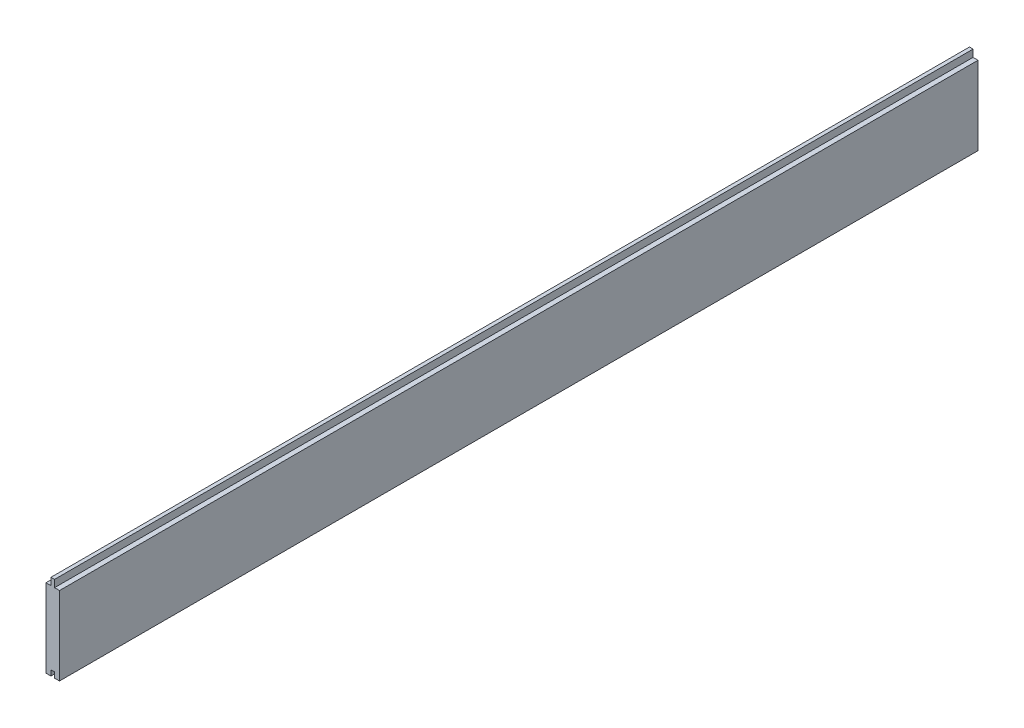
ISO-10303-21;
HEADER;
FILE_DESCRIPTION(('STEP AP214'),'2;1');
FILE_NAME('part.step','',(''),(''),'','','');
FILE_SCHEMA(('AUTOMOTIVE_DESIGN { 1 0 10303 214 1 1 1 1 }'));
ENDSEC;
DATA;
#1=APPLICATION_CONTEXT('core data for automotive mechanical design processes');
#2=APPLICATION_PROTOCOL_DEFINITION('international standard','automotive_design',2000,#1);
#3=PRODUCT_CONTEXT('',#1,'mechanical');
#4=PRODUCT('Part','Part','',(#3));
#5=PRODUCT_RELATED_PRODUCT_CATEGORY('part','',(#4));
#6=PRODUCT_DEFINITION_FORMATION('','',#4);
#7=PRODUCT_DEFINITION_CONTEXT('part definition',#1,'design');
#8=PRODUCT_DEFINITION('design','',#6,#7);
#9=PRODUCT_DEFINITION_SHAPE('','',#8);
#10=(LENGTH_UNIT() NAMED_UNIT(*) SI_UNIT(.MILLI.,.METRE.));
#11=(NAMED_UNIT(*) PLANE_ANGLE_UNIT() SI_UNIT($,.RADIAN.));
#12=(NAMED_UNIT(*) SI_UNIT($,.STERADIAN.) SOLID_ANGLE_UNIT());
#13=UNCERTAINTY_MEASURE_WITH_UNIT(LENGTH_MEASURE(1.E-05),#10,'distance_accuracy_value','');
#14=(GEOMETRIC_REPRESENTATION_CONTEXT(3) GLOBAL_UNCERTAINTY_ASSIGNED_CONTEXT((#13)) GLOBAL_UNIT_ASSIGNED_CONTEXT((#10,
#11,#12)) REPRESENTATION_CONTEXT('',''));
#15=CARTESIAN_POINT('',(0.,0.,0.));
#16=DIRECTION('',(0.,0.,1.));
#17=DIRECTION('',(1.,0.,0.));
#18=AXIS2_PLACEMENT_3D('',#15,#16,#17);
#19=CARTESIAN_POINT('',(1.99999999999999,0.,1020.));
#20=DIRECTION('',(1.,0.,0.));
#21=DIRECTION('',(0.,1.,0.));
#22=AXIS2_PLACEMENT_3D('',#19,#20,#21);
#23=PLANE('',#22);
#24=DIRECTION('',(0.,-1.,0.));
#25=VECTOR('',#24,1.);
#26=CARTESIAN_POINT('',(1.99999999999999,0.,0.));
#27=LINE('',#26,#25);
#28=CARTESIAN_POINT('',(1.99999999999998,51.5,0.));
#29=VERTEX_POINT('',#28);
#30=CARTESIAN_POINT('',(1.99999999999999,43.5,0.));
#31=VERTEX_POINT('',#30);
#32=EDGE_CURVE('E152',#29,#31,#27,.T.);
#33=ORIENTED_EDGE('',*,*,#32,.F.);
#34=DIRECTION('',(0.,0.,-1.));
#35=VECTOR('',#34,1.);
#36=CARTESIAN_POINT('',(1.99999999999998,51.5,1020.));
#37=LINE('',#36,#35);
#38=CARTESIAN_POINT('',(1.99999999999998,51.5,1020.));
#39=VERTEX_POINT('',#38);
#40=EDGE_CURVE('E11',#39,#29,#37,.T.);
#41=ORIENTED_EDGE('',*,*,#40,.F.);
#42=DIRECTION('',(0.,-1.,0.));
#43=VECTOR('',#42,1.);
#44=CARTESIAN_POINT('',(1.99999999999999,0.,1020.));
#45=LINE('',#44,#43);
#46=CARTESIAN_POINT('',(1.99999999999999,43.5,1020.));
#47=VERTEX_POINT('',#46);
#48=EDGE_CURVE('E212',#39,#47,#45,.T.);
#49=ORIENTED_EDGE('',*,*,#48,.T.);
#50=DIRECTION('',(0.,0.,-1.));
#51=VECTOR('',#50,1.);
#52=CARTESIAN_POINT('',(1.99999999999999,43.5,1020.));
#53=LINE('',#52,#51);
#54=EDGE_CURVE('E48',#47,#31,#53,.T.);
#55=ORIENTED_EDGE('',*,*,#54,.T.);
#56=EDGE_LOOP('',(#33,#41,#49,#55));
#57=FACE_BOUND('',#56,.T.);
#58=ADVANCED_FACE('F32',(#57),#23,.T.);
#59=CARTESIAN_POINT('',(0.,51.5,1020.));
#60=DIRECTION('',(0.,1.,0.));
#61=DIRECTION('',(0.,0.,1.));
#62=AXIS2_PLACEMENT_3D('',#59,#60,#61);
#63=PLANE('',#62);
#64=DIRECTION('',(1.,0.,0.));
#65=VECTOR('',#64,1.);
#66=CARTESIAN_POINT('',(0.,51.5,0.));
#67=LINE('',#66,#65);
#68=CARTESIAN_POINT('',(-2.00000000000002,51.5,0.));
#69=VERTEX_POINT('',#68);
#70=EDGE_CURVE('E154',#69,#29,#67,.T.);
#71=ORIENTED_EDGE('',*,*,#70,.F.);
#72=DIRECTION('',(0.,0.,-1.));
#73=VECTOR('',#72,1.);
#74=CARTESIAN_POINT('',(-2.00000000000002,51.5,1020.));
#75=LINE('',#74,#73);
#76=CARTESIAN_POINT('',(-2.00000000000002,51.5,1020.));
#77=VERTEX_POINT('',#76);
#78=EDGE_CURVE('E40',#77,#69,#75,.T.);
#79=ORIENTED_EDGE('',*,*,#78,.F.);
#80=DIRECTION('',(1.,0.,0.));
#81=VECTOR('',#80,1.);
#82=CARTESIAN_POINT('',(0.,51.5,1020.));
#83=LINE('',#82,#81);
#84=EDGE_CURVE('E209',#77,#39,#83,.T.);
#85=ORIENTED_EDGE('',*,*,#84,.T.);
#86=ORIENTED_EDGE('',*,*,#40,.T.);
#87=EDGE_LOOP('',(#71,#79,#85,#86));
#88=FACE_BOUND('',#87,.T.);
#89=ADVANCED_FACE('F208',(#88),#63,.T.);
#90=CARTESIAN_POINT('',(-2.00000000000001,0.,1020.));
#91=DIRECTION('',(1.,0.,0.));
#92=DIRECTION('',(0.,1.,0.));
#93=AXIS2_PLACEMENT_3D('',#90,#91,#92);
#94=PLANE('',#93);
#95=DIRECTION('',(0.,-1.,0.));
#96=VECTOR('',#95,1.);
#97=CARTESIAN_POINT('',(-2.00000000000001,0.,0.));
#98=LINE('',#97,#96);
#99=CARTESIAN_POINT('',(-2.00000000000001,43.5,0.));
#100=VERTEX_POINT('',#99);
#101=EDGE_CURVE('E157',#69,#100,#98,.T.);
#102=ORIENTED_EDGE('',*,*,#101,.T.);
#103=DIRECTION('',(0.,0.,-1.));
#104=VECTOR('',#103,1.);
#105=CARTESIAN_POINT('',(-2.00000000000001,43.5,1020.));
#106=LINE('',#105,#104);
#107=CARTESIAN_POINT('',(-2.00000000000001,43.5,1020.));
#108=VERTEX_POINT('',#107);
#109=EDGE_CURVE('E193',#108,#100,#106,.T.);
#110=ORIENTED_EDGE('',*,*,#109,.F.);
#111=DIRECTION('',(0.,-1.,0.));
#112=VECTOR('',#111,1.);
#113=CARTESIAN_POINT('',(-2.00000000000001,0.,1020.));
#114=LINE('',#113,#112);
#115=EDGE_CURVE('E199',#77,#108,#114,.T.);
#116=ORIENTED_EDGE('',*,*,#115,.F.);
#117=ORIENTED_EDGE('',*,*,#78,.T.);
#118=EDGE_LOOP('',(#102,#110,#116,#117));
#119=FACE_BOUND('',#118,.T.);
#120=ADVANCED_FACE('F197',(#119),#94,.F.);
#121=CARTESIAN_POINT('',(0.,43.5,1020.));
#122=DIRECTION('',(0.,1.,0.));
#123=DIRECTION('',(0.,0.,1.));
#124=AXIS2_PLACEMENT_3D('',#121,#122,#123);
#125=PLANE('',#124);
#126=DIRECTION('',(1.,0.,0.));
#127=VECTOR('',#126,1.);
#128=CARTESIAN_POINT('',(0.,43.5,0.));
#129=LINE('',#128,#127);
#130=CARTESIAN_POINT('',(-7.50000000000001,43.5,0.));
#131=VERTEX_POINT('',#130);
#132=EDGE_CURVE('E160',#131,#100,#129,.T.);
#133=ORIENTED_EDGE('',*,*,#132,.F.);
#134=DIRECTION('',(0.,0.,-1.));
#135=VECTOR('',#134,1.);
#136=CARTESIAN_POINT('',(-7.50000000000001,43.5,1020.));
#137=LINE('',#136,#135);
#138=CARTESIAN_POINT('',(-7.50000000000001,43.5,1020.));
#139=VERTEX_POINT('',#138);
#140=EDGE_CURVE('E191',#139,#131,#137,.T.);
#141=ORIENTED_EDGE('',*,*,#140,.F.);
#142=DIRECTION('',(1.,0.,0.));
#143=VECTOR('',#142,1.);
#144=CARTESIAN_POINT('',(0.,43.5,1020.));
#145=LINE('',#144,#143);
#146=EDGE_CURVE('E148',#139,#108,#145,.T.);
#147=ORIENTED_EDGE('',*,*,#146,.T.);
#148=ORIENTED_EDGE('',*,*,#109,.T.);
#149=EDGE_LOOP('',(#133,#141,#147,#148));
#150=FACE_BOUND('',#149,.T.);
#151=ADVANCED_FACE('F243',(#150),#125,.T.);
#152=CARTESIAN_POINT('',(-7.5,0.,1020.));
#153=DIRECTION('',(1.,0.,0.));
#154=DIRECTION('',(0.,1.,0.));
#155=AXIS2_PLACEMENT_3D('',#152,#153,#154);
#156=PLANE('',#155);
#157=DIRECTION('',(0.,-1.,0.));
#158=VECTOR('',#157,1.);
#159=CARTESIAN_POINT('',(-7.5,0.,0.));
#160=LINE('',#159,#158);
#161=CARTESIAN_POINT('',(-7.49999999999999,-43.5,0.));
#162=VERTEX_POINT('',#161);
#163=EDGE_CURVE('E163',#131,#162,#160,.T.);
#164=ORIENTED_EDGE('',*,*,#163,.T.);
#165=DIRECTION('',(0.,0.,-1.));
#166=VECTOR('',#165,1.);
#167=CARTESIAN_POINT('',(-7.49999999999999,-43.5,1020.));
#168=LINE('',#167,#166);
#169=CARTESIAN_POINT('',(-7.49999999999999,-43.5,1020.));
#170=VERTEX_POINT('',#169);
#171=EDGE_CURVE('E188',#170,#162,#168,.T.);
#172=ORIENTED_EDGE('',*,*,#171,.F.);
#173=DIRECTION('',(0.,-1.,0.));
#174=VECTOR('',#173,1.);
#175=CARTESIAN_POINT('',(-7.5,0.,1020.));
#176=LINE('',#175,#174);
#177=EDGE_CURVE('E218',#139,#170,#176,.T.);
#178=ORIENTED_EDGE('',*,*,#177,.F.);
#179=ORIENTED_EDGE('',*,*,#140,.T.);
#180=EDGE_LOOP('',(#164,#172,#178,#179));
#181=FACE_BOUND('',#180,.T.);
#182=ADVANCED_FACE('F246',(#181),#156,.F.);
#183=CARTESIAN_POINT('',(0.,-43.5,1020.));
#184=DIRECTION('',(0.,1.,0.));
#185=DIRECTION('',(0.,0.,1.));
#186=AXIS2_PLACEMENT_3D('',#183,#184,#185);
#187=PLANE('',#186);
#188=DIRECTION('',(1.,0.,0.));
#189=VECTOR('',#188,1.);
#190=CARTESIAN_POINT('',(0.,-43.5,0.));
#191=LINE('',#190,#189);
#192=CARTESIAN_POINT('',(-2.,-43.5,0.));
#193=VERTEX_POINT('',#192);
#194=EDGE_CURVE('E166',#162,#193,#191,.T.);
#195=ORIENTED_EDGE('',*,*,#194,.T.);
#196=DIRECTION('',(0.,0.,-1.));
#197=VECTOR('',#196,1.);
#198=CARTESIAN_POINT('',(-2.,-43.5,1020.));
#199=LINE('',#198,#197);
#200=CARTESIAN_POINT('',(-2.,-43.5,1020.));
#201=VERTEX_POINT('',#200);
#202=EDGE_CURVE('E186',#201,#193,#199,.T.);
#203=ORIENTED_EDGE('',*,*,#202,.F.);
#204=DIRECTION('',(1.,0.,0.));
#205=VECTOR('',#204,1.);
#206=CARTESIAN_POINT('',(0.,-43.5,1020.));
#207=LINE('',#206,#205);
#208=EDGE_CURVE('E134',#170,#201,#207,.T.);
#209=ORIENTED_EDGE('',*,*,#208,.F.);
#210=ORIENTED_EDGE('',*,*,#171,.T.);
#211=EDGE_LOOP('',(#195,#203,#209,#210));
#212=FACE_BOUND('',#211,.T.);
#213=ADVANCED_FACE('F239',(#212),#187,.F.);
#214=CARTESIAN_POINT('',(-2.,0.,1020.));
#215=DIRECTION('',(1.,0.,0.));
#216=DIRECTION('',(0.,1.,0.));
#217=AXIS2_PLACEMENT_3D('',#214,#215,#216);
#218=PLANE('',#217);
#219=DIRECTION('',(0.,-1.,0.));
#220=VECTOR('',#219,1.);
#221=CARTESIAN_POINT('',(-2.,0.,0.));
#222=LINE('',#221,#220);
#223=CARTESIAN_POINT('',(-2.,-37.5,0.));
#224=VERTEX_POINT('',#223);
#225=EDGE_CURVE('E169',#224,#193,#222,.T.);
#226=ORIENTED_EDGE('',*,*,#225,.F.);
#227=DIRECTION('',(0.,0.,-1.));
#228=VECTOR('',#227,1.);
#229=CARTESIAN_POINT('',(-2.,-37.5,1020.));
#230=LINE('',#229,#228);
#231=CARTESIAN_POINT('',(-2.,-37.5,1020.));
#232=VERTEX_POINT('',#231);
#233=EDGE_CURVE('E184',#232,#224,#230,.T.);
#234=ORIENTED_EDGE('',*,*,#233,.F.);
#235=DIRECTION('',(0.,-1.,0.));
#236=VECTOR('',#235,1.);
#237=CARTESIAN_POINT('',(-2.,0.,1020.));
#238=LINE('',#237,#236);
#239=EDGE_CURVE('E220',#232,#201,#238,.T.);
#240=ORIENTED_EDGE('',*,*,#239,.T.);
#241=ORIENTED_EDGE('',*,*,#202,.T.);
#242=EDGE_LOOP('',(#226,#234,#240,#241));
#243=FACE_BOUND('',#242,.T.);
#244=ADVANCED_FACE('F235',(#243),#218,.T.);
#245=CARTESIAN_POINT('',(0.,-37.5,1020.));
#246=DIRECTION('',(0.,1.,0.));
#247=DIRECTION('',(0.,0.,1.));
#248=AXIS2_PLACEMENT_3D('',#245,#246,#247);
#249=PLANE('',#248);
#250=DIRECTION('',(1.,0.,0.));
#251=VECTOR('',#250,1.);
#252=CARTESIAN_POINT('',(0.,-37.5,0.));
#253=LINE('',#252,#251);
#254=CARTESIAN_POINT('',(2.,-37.5,0.));
#255=VERTEX_POINT('',#254);
#256=EDGE_CURVE('E172',#224,#255,#253,.T.);
#257=ORIENTED_EDGE('',*,*,#256,.T.);
#258=DIRECTION('',(0.,0.,-1.));
#259=VECTOR('',#258,1.);
#260=CARTESIAN_POINT('',(2.,-37.5,1020.));
#261=LINE('',#260,#259);
#262=CARTESIAN_POINT('',(2.,-37.5,1020.));
#263=VERTEX_POINT('',#262);
#264=EDGE_CURVE('E181',#263,#255,#261,.T.);
#265=ORIENTED_EDGE('',*,*,#264,.F.);
#266=DIRECTION('',(1.,0.,0.));
#267=VECTOR('',#266,1.);
#268=CARTESIAN_POINT('',(0.,-37.5,1020.));
#269=LINE('',#268,#267);
#270=EDGE_CURVE('E222',#232,#263,#269,.T.);
#271=ORIENTED_EDGE('',*,*,#270,.F.);
#272=ORIENTED_EDGE('',*,*,#233,.T.);
#273=EDGE_LOOP('',(#257,#265,#271,#272));
#274=FACE_BOUND('',#273,.T.);
#275=ADVANCED_FACE('F227',(#274),#249,.F.);
#276=CARTESIAN_POINT('',(2.,0.,1020.));
#277=DIRECTION('',(1.,0.,0.));
#278=DIRECTION('',(0.,1.,0.));
#279=AXIS2_PLACEMENT_3D('',#276,#277,#278);
#280=PLANE('',#279);
#281=DIRECTION('',(0.,-1.,0.));
#282=VECTOR('',#281,1.);
#283=CARTESIAN_POINT('',(2.,0.,0.));
#284=LINE('',#283,#282);
#285=CARTESIAN_POINT('',(2.,-43.5,0.));
#286=VERTEX_POINT('',#285);
#287=EDGE_CURVE('E174',#255,#286,#284,.T.);
#288=ORIENTED_EDGE('',*,*,#287,.T.);
#289=DIRECTION('',(0.,0.,-1.));
#290=VECTOR('',#289,1.);
#291=CARTESIAN_POINT('',(2.,-43.5,1020.));
#292=LINE('',#291,#290);
#293=CARTESIAN_POINT('',(2.,-43.5,1020.));
#294=VERTEX_POINT('',#293);
#295=EDGE_CURVE('E142',#294,#286,#292,.T.);
#296=ORIENTED_EDGE('',*,*,#295,.F.);
#297=DIRECTION('',(0.,-1.,0.));
#298=VECTOR('',#297,1.);
#299=CARTESIAN_POINT('',(2.,0.,1020.));
#300=LINE('',#299,#298);
#301=EDGE_CURVE('E129',#263,#294,#300,.T.);
#302=ORIENTED_EDGE('',*,*,#301,.F.);
#303=ORIENTED_EDGE('',*,*,#264,.T.);
#304=EDGE_LOOP('',(#288,#296,#302,#303));
#305=FACE_BOUND('',#304,.T.);
#306=ADVANCED_FACE('F231',(#305),#280,.F.);
#307=CARTESIAN_POINT('',(7.49999999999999,-43.5,0.));
#308=VERTEX_POINT('',#307);
#309=EDGE_CURVE('E139',#286,#308,#191,.T.);
#310=ORIENTED_EDGE('',*,*,#309,.T.);
#311=DIRECTION('',(0.,0.,-1.));
#312=VECTOR('',#311,1.);
#313=CARTESIAN_POINT('',(7.49999999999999,-43.5,1020.));
#314=LINE('',#313,#312);
#315=CARTESIAN_POINT('',(7.49999999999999,-43.5,1020.));
#316=VERTEX_POINT('',#315);
#317=EDGE_CURVE('E136',#316,#308,#314,.T.);
#318=ORIENTED_EDGE('',*,*,#317,.F.);
#319=EDGE_CURVE('E122',#294,#316,#207,.T.);
#320=ORIENTED_EDGE('',*,*,#319,.F.);
#321=ORIENTED_EDGE('',*,*,#295,.T.);
#322=EDGE_LOOP('',(#310,#318,#320,#321));
#323=FACE_BOUND('',#322,.T.);
#324=ADVANCED_FACE('F137',(#323),#187,.F.);
#325=CARTESIAN_POINT('',(7.49999999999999,0.,1020.));
#326=DIRECTION('',(1.,0.,0.));
#327=DIRECTION('',(0.,1.,0.));
#328=AXIS2_PLACEMENT_3D('',#325,#326,#327);
#329=PLANE('',#328);
#330=DIRECTION('',(0.,-1.,0.));
#331=VECTOR('',#330,1.);
#332=CARTESIAN_POINT('',(7.49999999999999,0.,0.));
#333=LINE('',#332,#331);
#334=CARTESIAN_POINT('',(7.49999999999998,43.5,0.));
#335=VERTEX_POINT('',#334);
#336=EDGE_CURVE('E176',#335,#308,#333,.T.);
#337=ORIENTED_EDGE('',*,*,#336,.F.);
#338=DIRECTION('',(0.,0.,-1.));
#339=VECTOR('',#338,1.);
#340=CARTESIAN_POINT('',(7.49999999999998,43.5,1020.));
#341=LINE('',#340,#339);
#342=CARTESIAN_POINT('',(7.49999999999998,43.5,1020.));
#343=VERTEX_POINT('',#342);
#344=EDGE_CURVE('E85',#343,#335,#341,.T.);
#345=ORIENTED_EDGE('',*,*,#344,.F.);
#346=DIRECTION('',(0.,-1.,0.));
#347=VECTOR('',#346,1.);
#348=CARTESIAN_POINT('',(7.49999999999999,0.,1020.));
#349=LINE('',#348,#347);
#350=EDGE_CURVE('E127',#343,#316,#349,.T.);
#351=ORIENTED_EDGE('',*,*,#350,.T.);
#352=ORIENTED_EDGE('',*,*,#317,.T.);
#353=EDGE_LOOP('',(#337,#345,#351,#352));
#354=FACE_BOUND('',#353,.T.);
#355=ADVANCED_FACE('F144',(#354),#329,.T.);
#356=EDGE_CURVE('E164',#31,#335,#129,.T.);
#357=ORIENTED_EDGE('',*,*,#356,.F.);
#358=ORIENTED_EDGE('',*,*,#54,.F.);
#359=EDGE_CURVE('E145',#47,#343,#145,.T.);
#360=ORIENTED_EDGE('',*,*,#359,.T.);
#361=ORIENTED_EDGE('',*,*,#344,.T.);
#362=EDGE_LOOP('',(#357,#358,#360,#361));
#363=FACE_BOUND('',#362,.T.);
#364=ADVANCED_FACE('F211',(#363),#125,.T.);
#365=CARTESIAN_POINT('',(0.,0.,1020.));
#366=DIRECTION('',(0.,0.,1.));
#367=DIRECTION('',(1.,0.,0.));
#368=AXIS2_PLACEMENT_3D('',#365,#366,#367);
#369=PLANE('',#368);
#370=ORIENTED_EDGE('',*,*,#48,.F.);
#371=ORIENTED_EDGE('',*,*,#84,.F.);
#372=ORIENTED_EDGE('',*,*,#115,.T.);
#373=ORIENTED_EDGE('',*,*,#146,.F.);
#374=ORIENTED_EDGE('',*,*,#177,.T.);
#375=ORIENTED_EDGE('',*,*,#208,.T.);
#376=ORIENTED_EDGE('',*,*,#239,.F.);
#377=ORIENTED_EDGE('',*,*,#270,.T.);
#378=ORIENTED_EDGE('',*,*,#301,.T.);
#379=ORIENTED_EDGE('',*,*,#319,.T.);
#380=ORIENTED_EDGE('',*,*,#350,.F.);
#381=ORIENTED_EDGE('',*,*,#359,.F.);
#382=EDGE_LOOP('',(#370,#371,#372,#373,#374,#375,#376,#377,#378,#379,#380,#381));
#383=FACE_BOUND('',#382,.T.);
#384=ADVANCED_FACE('F124',(#383),#369,.T.);
#385=CARTESIAN_POINT('',(0.,0.,0.));
#386=DIRECTION('',(0.,0.,1.));
#387=DIRECTION('',(1.,0.,0.));
#388=AXIS2_PLACEMENT_3D('',#385,#386,#387);
#389=PLANE('',#388);
#390=ORIENTED_EDGE('',*,*,#32,.T.);
#391=ORIENTED_EDGE('',*,*,#356,.T.);
#392=ORIENTED_EDGE('',*,*,#336,.T.);
#393=ORIENTED_EDGE('',*,*,#309,.F.);
#394=ORIENTED_EDGE('',*,*,#287,.F.);
#395=ORIENTED_EDGE('',*,*,#256,.F.);
#396=ORIENTED_EDGE('',*,*,#225,.T.);
#397=ORIENTED_EDGE('',*,*,#194,.F.);
#398=ORIENTED_EDGE('',*,*,#163,.F.);
#399=ORIENTED_EDGE('',*,*,#132,.T.);
#400=ORIENTED_EDGE('',*,*,#101,.F.);
#401=ORIENTED_EDGE('',*,*,#70,.T.);
#402=EDGE_LOOP('',(#390,#391,#392,#393,#394,#395,#396,#397,#398,#399,#400,#401));
#403=FACE_BOUND('',#402,.T.);
#404=ADVANCED_FACE('F205',(#403),#389,.F.);
#405=CLOSED_SHELL('',(#58,#89,#120,#151,#182,#213,#244,#275,#306,#324,#355,#364,#384,#404));
#406=MANIFOLD_SOLID_BREP('B2',#405);
#407=ADVANCED_BREP_SHAPE_REPRESENTATION('',(#18,#406),#14);
#408=SHAPE_DEFINITION_REPRESENTATION(#9,#407);
ENDSEC;
END-ISO-10303-21;
